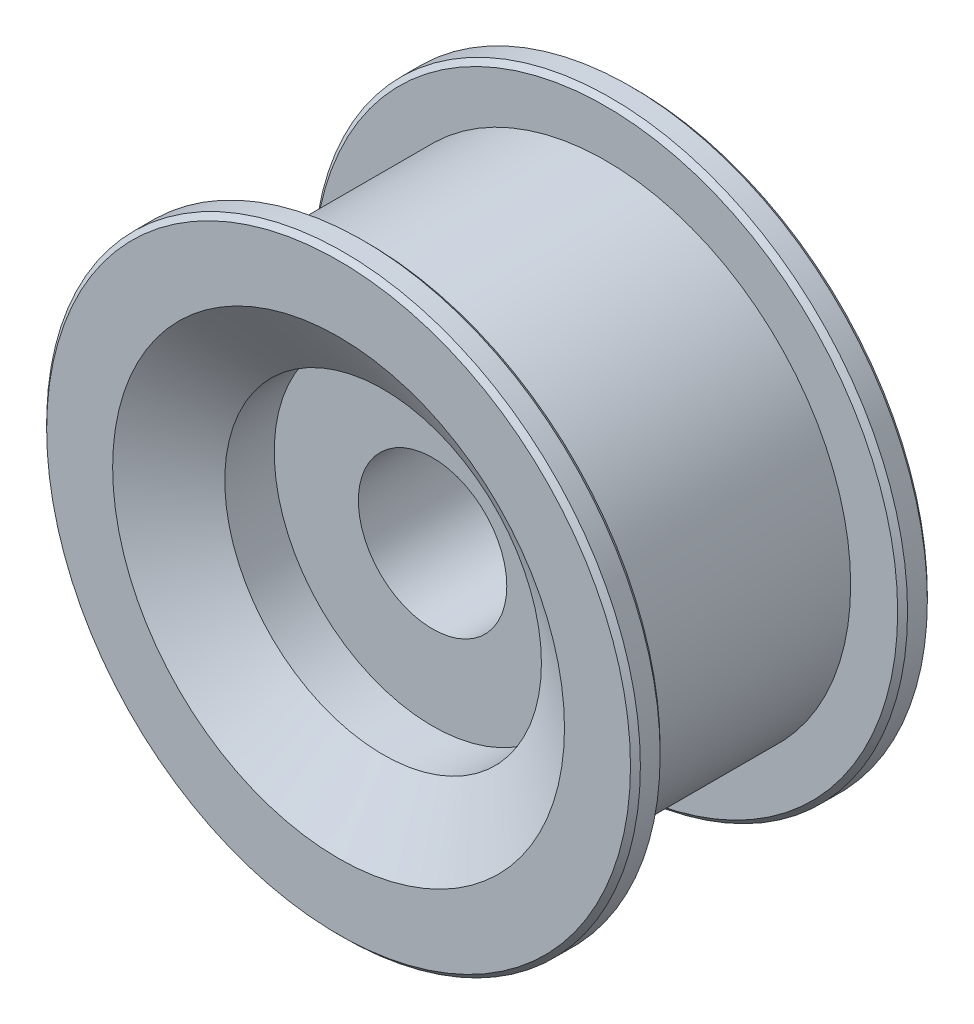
ISO-10303-21;
HEADER;
FILE_DESCRIPTION(('STEP AP214'),'2;1');
FILE_NAME('part.step','',(''),(''),'','','');
FILE_SCHEMA(('AUTOMOTIVE_DESIGN { 1 0 10303 214 1 1 1 1 }'));
ENDSEC;
DATA;
#1=APPLICATION_CONTEXT('core data for automotive mechanical design processes');
#2=APPLICATION_PROTOCOL_DEFINITION('international standard','automotive_design',2000,#1);
#3=PRODUCT_CONTEXT('',#1,'mechanical');
#4=PRODUCT('Part','Part','',(#3));
#5=PRODUCT_RELATED_PRODUCT_CATEGORY('part','',(#4));
#6=PRODUCT_DEFINITION_FORMATION('','',#4);
#7=PRODUCT_DEFINITION_CONTEXT('part definition',#1,'design');
#8=PRODUCT_DEFINITION('design','',#6,#7);
#9=PRODUCT_DEFINITION_SHAPE('','',#8);
#10=(LENGTH_UNIT() NAMED_UNIT(*) SI_UNIT(.MILLI.,.METRE.));
#11=(NAMED_UNIT(*) PLANE_ANGLE_UNIT() SI_UNIT($,.RADIAN.));
#12=(NAMED_UNIT(*) SI_UNIT($,.STERADIAN.) SOLID_ANGLE_UNIT());
#13=UNCERTAINTY_MEASURE_WITH_UNIT(LENGTH_MEASURE(1.E-05),#10,'distance_accuracy_value','');
#14=(GEOMETRIC_REPRESENTATION_CONTEXT(3) GLOBAL_UNCERTAINTY_ASSIGNED_CONTEXT((#13)) GLOBAL_UNIT_ASSIGNED_CONTEXT((#10,
#11,#12)) REPRESENTATION_CONTEXT('',''));
#15=CARTESIAN_POINT('',(0.,0.,0.));
#16=DIRECTION('',(0.,0.,1.));
#17=DIRECTION('',(1.,0.,0.));
#18=AXIS2_PLACEMENT_3D('',#15,#16,#17);
#19=CARTESIAN_POINT('',(0.,0.,19.75));
#20=DIRECTION('',(0.,0.,1.));
#21=DIRECTION('',(1.,0.,0.));
#22=AXIS2_PLACEMENT_3D('',#19,#20,#21);
#23=CYLINDRICAL_SURFACE('',#22,7.5000000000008);
#24=CARTESIAN_POINT('',(0.,0.,-5.5));
#25=DIRECTION('',(0.,0.,1.));
#26=DIRECTION('',(1.,0.,0.));
#27=AXIS2_PLACEMENT_3D('',#24,#25,#26);
#28=CIRCLE('',#27,7.5000000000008);
#29=CARTESIAN_POINT('',(7.5000000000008,0.,-5.5));
#30=VERTEX_POINT('',#29);
#31=EDGE_CURVE('E8',#30,#30,#28,.T.);
#32=ORIENTED_EDGE('',*,*,#31,.F.);
#33=EDGE_LOOP('',(#32));
#34=FACE_BOUND('',#33,.T.);
#35=CARTESIAN_POINT('',(0.,0.,5.5));
#36=DIRECTION('',(0.,0.,1.));
#37=DIRECTION('',(1.,0.,0.));
#38=AXIS2_PLACEMENT_3D('',#35,#36,#37);
#39=CIRCLE('',#38,7.5000000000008);
#40=CARTESIAN_POINT('',(7.5000000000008,0.,5.5));
#41=VERTEX_POINT('',#40);
#42=EDGE_CURVE('E70',#41,#41,#39,.T.);
#43=ORIENTED_EDGE('',*,*,#42,.T.);
#44=EDGE_LOOP('',(#43));
#45=FACE_BOUND('',#44,.T.);
#46=ADVANCED_FACE('F12',(#34,#45),#23,.F.);
#47=CARTESIAN_POINT('',(0.,7.5000000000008,-5.5));
#48=DIRECTION('',(0.,0.,1.));
#49=DIRECTION('',(1.,0.,0.));
#50=AXIS2_PLACEMENT_3D('',#47,#48,#49);
#51=PLANE('',#50);
#52=CARTESIAN_POINT('',(0.,0.,-5.5));
#53=DIRECTION('',(0.,0.,1.));
#54=DIRECTION('',(1.,0.,0.));
#55=AXIS2_PLACEMENT_3D('',#52,#53,#54);
#56=CIRCLE('',#55,16.);
#57=CARTESIAN_POINT('',(16.,0.,-5.5));
#58=VERTEX_POINT('',#57);
#59=EDGE_CURVE('E18',#58,#58,#56,.T.);
#60=ORIENTED_EDGE('',*,*,#59,.F.);
#61=EDGE_LOOP('',(#60));
#62=FACE_BOUND('',#61,.T.);
#63=ORIENTED_EDGE('',*,*,#31,.T.);
#64=EDGE_LOOP('',(#63));
#65=FACE_BOUND('',#64,.T.);
#66=ADVANCED_FACE('F167',(#62,#65),#51,.F.);
#67=CARTESIAN_POINT('',(0.,0.,19.75));
#68=DIRECTION('',(0.,0.,1.));
#69=DIRECTION('',(1.,0.,0.));
#70=AXIS2_PLACEMENT_3D('',#67,#68,#69);
#71=CYLINDRICAL_SURFACE('',#70,16.);
#72=CARTESIAN_POINT('',(0.,0.,-10.5));
#73=DIRECTION('',(0.,0.,1.));
#74=DIRECTION('',(1.,0.,0.));
#75=AXIS2_PLACEMENT_3D('',#72,#73,#74);
#76=CIRCLE('',#75,16.);
#77=CARTESIAN_POINT('',(16.,0.,-10.5));
#78=VERTEX_POINT('',#77);
#79=EDGE_CURVE('E22',#78,#78,#76,.T.);
#80=ORIENTED_EDGE('',*,*,#79,.F.);
#81=EDGE_LOOP('',(#80));
#82=FACE_BOUND('',#81,.T.);
#83=ORIENTED_EDGE('',*,*,#59,.T.);
#84=EDGE_LOOP('',(#83));
#85=FACE_BOUND('',#84,.T.);
#86=ADVANCED_FACE('F162',(#82,#85),#71,.F.);
#87=CARTESIAN_POINT('',(0.,0.,-10.5));
#88=DIRECTION('',(0.,0.,-1.));
#89=DIRECTION('',(-1.,0.,0.));
#90=AXIS2_PLACEMENT_3D('',#87,#88,#89);
#91=CONICAL_SURFACE('',#90,16.,0.988243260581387);
#92=CARTESIAN_POINT('',(0.,0.,-15.));
#93=DIRECTION('',(0.,0.,1.));
#94=DIRECTION('',(1.,0.,0.));
#95=AXIS2_PLACEMENT_3D('',#92,#93,#94);
#96=CIRCLE('',#95,22.8303571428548);
#97=CARTESIAN_POINT('',(22.8303571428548,0.,-15.));
#98=VERTEX_POINT('',#97);
#99=EDGE_CURVE('E26',#98,#98,#96,.T.);
#100=ORIENTED_EDGE('',*,*,#99,.F.);
#101=EDGE_LOOP('',(#100));
#102=FACE_BOUND('',#101,.T.);
#103=ORIENTED_EDGE('',*,*,#79,.T.);
#104=EDGE_LOOP('',(#103));
#105=FACE_BOUND('',#104,.T.);
#106=ADVANCED_FACE('F156',(#102,#105),#91,.F.);
#107=CARTESIAN_POINT('',(0.,22.8303571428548,-15.));
#108=DIRECTION('',(0.,0.,1.));
#109=DIRECTION('',(1.,0.,0.));
#110=AXIS2_PLACEMENT_3D('',#107,#108,#109);
#111=PLANE('',#110);
#112=CARTESIAN_POINT('',(0.,0.,-15.));
#113=DIRECTION('',(0.,0.,1.));
#114=DIRECTION('',(1.,0.,0.));
#115=AXIS2_PLACEMENT_3D('',#112,#113,#114);
#116=CIRCLE('',#115,29.5);
#117=CARTESIAN_POINT('',(29.5,0.,-15.));
#118=VERTEX_POINT('',#117);
#119=EDGE_CURVE('E31',#118,#118,#116,.T.);
#120=ORIENTED_EDGE('',*,*,#119,.F.);
#121=EDGE_LOOP('',(#120));
#122=FACE_BOUND('',#121,.T.);
#123=ORIENTED_EDGE('',*,*,#99,.T.);
#124=EDGE_LOOP('',(#123));
#125=FACE_BOUND('',#124,.T.);
#126=ADVANCED_FACE('F150',(#122,#125),#111,.F.);
#127=CARTESIAN_POINT('',(0.,0.,-15.));
#128=DIRECTION('',(0.,0.,1.));
#129=DIRECTION('',(1.,0.,0.));
#130=AXIS2_PLACEMENT_3D('',#127,#128,#129);
#131=CONICAL_SURFACE('',#130,29.5,0.785398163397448);
#132=CARTESIAN_POINT('',(0.,0.,-14.5));
#133=DIRECTION('',(0.,0.,1.));
#134=DIRECTION('',(1.,0.,0.));
#135=AXIS2_PLACEMENT_3D('',#132,#133,#134);
#136=CIRCLE('',#135,30.);
#137=CARTESIAN_POINT('',(30.,0.,-14.5));
#138=VERTEX_POINT('',#137);
#139=EDGE_CURVE('E34',#138,#138,#136,.T.);
#140=ORIENTED_EDGE('',*,*,#139,.F.);
#141=EDGE_LOOP('',(#140));
#142=FACE_BOUND('',#141,.T.);
#143=ORIENTED_EDGE('',*,*,#119,.T.);
#144=EDGE_LOOP('',(#143));
#145=FACE_BOUND('',#144,.T.);
#146=ADVANCED_FACE('F144',(#142,#145),#131,.T.);
#147=CARTESIAN_POINT('',(0.,0.,19.75));
#148=DIRECTION('',(0.,0.,1.));
#149=DIRECTION('',(1.,0.,0.));
#150=AXIS2_PLACEMENT_3D('',#147,#148,#149);
#151=CYLINDRICAL_SURFACE('',#150,30.);
#152=CARTESIAN_POINT('',(0.,0.,-12.5));
#153=DIRECTION('',(0.,0.,1.));
#154=DIRECTION('',(1.,0.,0.));
#155=AXIS2_PLACEMENT_3D('',#152,#153,#154);
#156=CIRCLE('',#155,30.);
#157=CARTESIAN_POINT('',(30.,0.,-12.5));
#158=VERTEX_POINT('',#157);
#159=EDGE_CURVE('E37',#158,#158,#156,.T.);
#160=ORIENTED_EDGE('',*,*,#159,.F.);
#161=EDGE_LOOP('',(#160));
#162=FACE_BOUND('',#161,.T.);
#163=ORIENTED_EDGE('',*,*,#139,.T.);
#164=EDGE_LOOP('',(#163));
#165=FACE_BOUND('',#164,.T.);
#166=ADVANCED_FACE('F138',(#162,#165),#151,.T.);
#167=CARTESIAN_POINT('',(0.,0.,-12.5));
#168=DIRECTION('',(0.,0.,-1.));
#169=DIRECTION('',(-1.,0.,0.));
#170=AXIS2_PLACEMENT_3D('',#167,#168,#169);
#171=CONICAL_SURFACE('',#170,30.,0.785398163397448);
#172=CARTESIAN_POINT('',(0.,0.,-12.));
#173=DIRECTION('',(0.,0.,1.));
#174=DIRECTION('',(1.,0.,0.));
#175=AXIS2_PLACEMENT_3D('',#172,#173,#174);
#176=CIRCLE('',#175,29.5);
#177=CARTESIAN_POINT('',(29.5,0.,-12.));
#178=VERTEX_POINT('',#177);
#179=EDGE_CURVE('E40',#178,#178,#176,.T.);
#180=ORIENTED_EDGE('',*,*,#179,.F.);
#181=EDGE_LOOP('',(#180));
#182=FACE_BOUND('',#181,.T.);
#183=ORIENTED_EDGE('',*,*,#159,.T.);
#184=EDGE_LOOP('',(#183));
#185=FACE_BOUND('',#184,.T.);
#186=ADVANCED_FACE('F132',(#182,#185),#171,.T.);
#187=CARTESIAN_POINT('',(0.,29.5,-12.));
#188=DIRECTION('',(0.,0.,-1.));
#189=DIRECTION('',(-1.,0.,0.));
#190=AXIS2_PLACEMENT_3D('',#187,#188,#189);
#191=PLANE('',#190);
#192=CARTESIAN_POINT('',(0.,0.,-12.));
#193=DIRECTION('',(0.,0.,1.));
#194=DIRECTION('',(1.,0.,0.));
#195=AXIS2_PLACEMENT_3D('',#192,#193,#194);
#196=CIRCLE('',#195,24.75);
#197=CARTESIAN_POINT('',(24.75,0.,-12.));
#198=VERTEX_POINT('',#197);
#199=EDGE_CURVE('E43',#198,#198,#196,.T.);
#200=ORIENTED_EDGE('',*,*,#199,.F.);
#201=EDGE_LOOP('',(#200));
#202=FACE_BOUND('',#201,.T.);
#203=ORIENTED_EDGE('',*,*,#179,.T.);
#204=EDGE_LOOP('',(#203));
#205=FACE_BOUND('',#204,.T.);
#206=ADVANCED_FACE('F126',(#202,#205),#191,.F.);
#207=CARTESIAN_POINT('',(0.,0.,19.75));
#208=DIRECTION('',(0.,0.,1.));
#209=DIRECTION('',(1.,0.,0.));
#210=AXIS2_PLACEMENT_3D('',#207,#208,#209);
#211=CYLINDRICAL_SURFACE('',#210,24.75);
#212=CARTESIAN_POINT('',(0.,0.,12.));
#213=DIRECTION('',(0.,0.,1.));
#214=DIRECTION('',(1.,0.,0.));
#215=AXIS2_PLACEMENT_3D('',#212,#213,#214);
#216=CIRCLE('',#215,24.75);
#217=CARTESIAN_POINT('',(24.75,0.,12.));
#218=VERTEX_POINT('',#217);
#219=EDGE_CURVE('E46',#218,#218,#216,.T.);
#220=ORIENTED_EDGE('',*,*,#219,.F.);
#221=EDGE_LOOP('',(#220));
#222=FACE_BOUND('',#221,.T.);
#223=ORIENTED_EDGE('',*,*,#199,.T.);
#224=EDGE_LOOP('',(#223));
#225=FACE_BOUND('',#224,.T.);
#226=ADVANCED_FACE('F120',(#222,#225),#211,.T.);
#227=CARTESIAN_POINT('',(0.,29.5,12.));
#228=DIRECTION('',(0.,0.,1.));
#229=DIRECTION('',(1.,0.,0.));
#230=AXIS2_PLACEMENT_3D('',#227,#228,#229);
#231=PLANE('',#230);
#232=CARTESIAN_POINT('',(0.,0.,12.));
#233=DIRECTION('',(0.,0.,1.));
#234=DIRECTION('',(1.,0.,0.));
#235=AXIS2_PLACEMENT_3D('',#232,#233,#234);
#236=CIRCLE('',#235,29.5);
#237=CARTESIAN_POINT('',(29.5,0.,12.));
#238=VERTEX_POINT('',#237);
#239=EDGE_CURVE('E49',#238,#238,#236,.T.);
#240=ORIENTED_EDGE('',*,*,#239,.F.);
#241=EDGE_LOOP('',(#240));
#242=FACE_BOUND('',#241,.T.);
#243=ORIENTED_EDGE('',*,*,#219,.T.);
#244=EDGE_LOOP('',(#243));
#245=FACE_BOUND('',#244,.T.);
#246=ADVANCED_FACE('F114',(#242,#245),#231,.F.);
#247=CARTESIAN_POINT('',(0.,0.,12.));
#248=DIRECTION('',(0.,0.,1.));
#249=DIRECTION('',(1.,0.,0.));
#250=AXIS2_PLACEMENT_3D('',#247,#248,#249);
#251=CONICAL_SURFACE('',#250,29.5,0.785398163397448);
#252=CARTESIAN_POINT('',(0.,0.,12.5));
#253=DIRECTION('',(0.,0.,1.));
#254=DIRECTION('',(1.,0.,0.));
#255=AXIS2_PLACEMENT_3D('',#252,#253,#254);
#256=CIRCLE('',#255,30.);
#257=CARTESIAN_POINT('',(30.,0.,12.5));
#258=VERTEX_POINT('',#257);
#259=EDGE_CURVE('E52',#258,#258,#256,.T.);
#260=ORIENTED_EDGE('',*,*,#259,.F.);
#261=EDGE_LOOP('',(#260));
#262=FACE_BOUND('',#261,.T.);
#263=ORIENTED_EDGE('',*,*,#239,.T.);
#264=EDGE_LOOP('',(#263));
#265=FACE_BOUND('',#264,.T.);
#266=ADVANCED_FACE('F108',(#262,#265),#251,.T.);
#267=CARTESIAN_POINT('',(0.,0.,19.75));
#268=DIRECTION('',(0.,0.,1.));
#269=DIRECTION('',(1.,0.,0.));
#270=AXIS2_PLACEMENT_3D('',#267,#268,#269);
#271=CYLINDRICAL_SURFACE('',#270,30.);
#272=CARTESIAN_POINT('',(0.,0.,14.5));
#273=DIRECTION('',(0.,0.,1.));
#274=DIRECTION('',(1.,0.,0.));
#275=AXIS2_PLACEMENT_3D('',#272,#273,#274);
#276=CIRCLE('',#275,30.);
#277=CARTESIAN_POINT('',(30.,0.,14.5));
#278=VERTEX_POINT('',#277);
#279=EDGE_CURVE('E55',#278,#278,#276,.T.);
#280=ORIENTED_EDGE('',*,*,#279,.F.);
#281=EDGE_LOOP('',(#280));
#282=FACE_BOUND('',#281,.T.);
#283=ORIENTED_EDGE('',*,*,#259,.T.);
#284=EDGE_LOOP('',(#283));
#285=FACE_BOUND('',#284,.T.);
#286=ADVANCED_FACE('F102',(#282,#285),#271,.T.);
#287=CARTESIAN_POINT('',(0.,0.,14.5));
#288=DIRECTION('',(0.,0.,-1.));
#289=DIRECTION('',(-1.,0.,0.));
#290=AXIS2_PLACEMENT_3D('',#287,#288,#289);
#291=CONICAL_SURFACE('',#290,30.,0.785398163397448);
#292=CARTESIAN_POINT('',(0.,0.,15.));
#293=DIRECTION('',(0.,0.,1.));
#294=DIRECTION('',(1.,0.,0.));
#295=AXIS2_PLACEMENT_3D('',#292,#293,#294);
#296=CIRCLE('',#295,29.5);
#297=CARTESIAN_POINT('',(29.5,0.,15.));
#298=VERTEX_POINT('',#297);
#299=EDGE_CURVE('E58',#298,#298,#296,.T.);
#300=ORIENTED_EDGE('',*,*,#299,.F.);
#301=EDGE_LOOP('',(#300));
#302=FACE_BOUND('',#301,.T.);
#303=ORIENTED_EDGE('',*,*,#279,.T.);
#304=EDGE_LOOP('',(#303));
#305=FACE_BOUND('',#304,.T.);
#306=ADVANCED_FACE('F96',(#302,#305),#291,.T.);
#307=CARTESIAN_POINT('',(0.,22.8303571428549,15.));
#308=DIRECTION('',(0.,0.,-1.));
#309=DIRECTION('',(-1.,0.,0.));
#310=AXIS2_PLACEMENT_3D('',#307,#308,#309);
#311=PLANE('',#310);
#312=CARTESIAN_POINT('',(0.,0.,15.));
#313=DIRECTION('',(0.,0.,1.));
#314=DIRECTION('',(1.,0.,0.));
#315=AXIS2_PLACEMENT_3D('',#312,#313,#314);
#316=CIRCLE('',#315,22.8303571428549);
#317=CARTESIAN_POINT('',(22.8303571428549,0.,15.));
#318=VERTEX_POINT('',#317);
#319=EDGE_CURVE('E61',#318,#318,#316,.T.);
#320=ORIENTED_EDGE('',*,*,#319,.F.);
#321=EDGE_LOOP('',(#320));
#322=FACE_BOUND('',#321,.T.);
#323=ORIENTED_EDGE('',*,*,#299,.T.);
#324=EDGE_LOOP('',(#323));
#325=FACE_BOUND('',#324,.T.);
#326=ADVANCED_FACE('F90',(#322,#325),#311,.F.);
#327=CARTESIAN_POINT('',(0.,0.,15.));
#328=DIRECTION('',(0.,0.,1.));
#329=DIRECTION('',(1.,0.,0.));
#330=AXIS2_PLACEMENT_3D('',#327,#328,#329);
#331=CONICAL_SURFACE('',#330,22.8303571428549,0.988243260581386);
#332=CARTESIAN_POINT('',(0.,0.,10.5));
#333=DIRECTION('',(0.,0.,1.));
#334=DIRECTION('',(1.,0.,0.));
#335=AXIS2_PLACEMENT_3D('',#332,#333,#334);
#336=CIRCLE('',#335,16.);
#337=CARTESIAN_POINT('',(16.,0.,10.5));
#338=VERTEX_POINT('',#337);
#339=EDGE_CURVE('E64',#338,#338,#336,.T.);
#340=ORIENTED_EDGE('',*,*,#339,.F.);
#341=EDGE_LOOP('',(#340));
#342=FACE_BOUND('',#341,.T.);
#343=ORIENTED_EDGE('',*,*,#319,.T.);
#344=EDGE_LOOP('',(#343));
#345=FACE_BOUND('',#344,.T.);
#346=ADVANCED_FACE('F84',(#342,#345),#331,.F.);
#347=CARTESIAN_POINT('',(0.,0.,19.75));
#348=DIRECTION('',(0.,0.,1.));
#349=DIRECTION('',(1.,0.,0.));
#350=AXIS2_PLACEMENT_3D('',#347,#348,#349);
#351=CYLINDRICAL_SURFACE('',#350,16.);
#352=CARTESIAN_POINT('',(0.,0.,5.5));
#353=DIRECTION('',(0.,0.,1.));
#354=DIRECTION('',(1.,0.,0.));
#355=AXIS2_PLACEMENT_3D('',#352,#353,#354);
#356=CIRCLE('',#355,16.);
#357=CARTESIAN_POINT('',(16.,0.,5.5));
#358=VERTEX_POINT('',#357);
#359=EDGE_CURVE('E67',#358,#358,#356,.T.);
#360=ORIENTED_EDGE('',*,*,#359,.F.);
#361=EDGE_LOOP('',(#360));
#362=FACE_BOUND('',#361,.T.);
#363=ORIENTED_EDGE('',*,*,#339,.T.);
#364=EDGE_LOOP('',(#363));
#365=FACE_BOUND('',#364,.T.);
#366=ADVANCED_FACE('F78',(#362,#365),#351,.F.);
#367=CARTESIAN_POINT('',(0.,16.,5.5));
#368=DIRECTION('',(0.,0.,-1.));
#369=DIRECTION('',(-1.,0.,0.));
#370=AXIS2_PLACEMENT_3D('',#367,#368,#369);
#371=PLANE('',#370);
#372=ORIENTED_EDGE('',*,*,#42,.F.);
#373=EDGE_LOOP('',(#372));
#374=FACE_BOUND('',#373,.T.);
#375=ORIENTED_EDGE('',*,*,#359,.T.);
#376=EDGE_LOOP('',(#375));
#377=FACE_BOUND('',#376,.T.);
#378=ADVANCED_FACE('F75',(#374,#377),#371,.F.);
#379=CLOSED_SHELL('',(#46,#66,#86,#106,#126,#146,#166,#186,#206,#226,#246,#266,#286,#306,#326,
#346,#366,#378));
#380=MANIFOLD_SOLID_BREP('B1',#379);
#381=ADVANCED_BREP_SHAPE_REPRESENTATION('',(#18,#380),#14);
#382=SHAPE_DEFINITION_REPRESENTATION(#9,#381);
ENDSEC;
END-ISO-10303-21;
